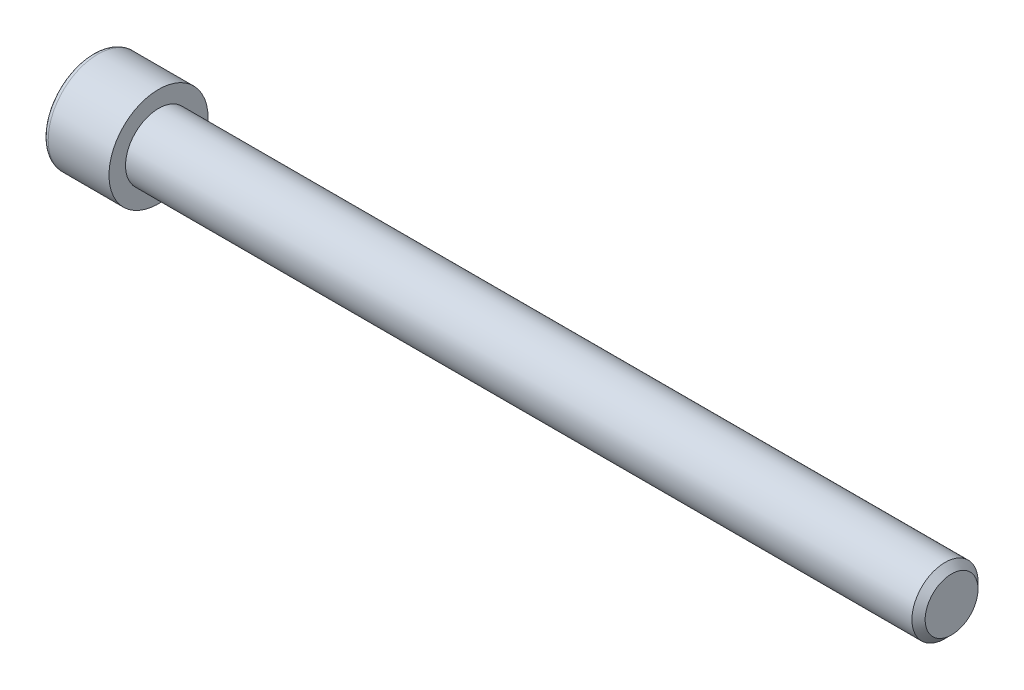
from build123d import *

# Parameters (mm, degrees)
CUT_EXTRUDE1_DEPTH = 3.9624
FILLET1_R          = 0.508
CHAMFER1_SIZE      = 0.635


with BuildPart() as part:
    # Sketch1 → Revolve1 (revolve)
    with BuildSketch(Plane.XY, mode=Mode.PRIVATE) as revolve1_sk:
        Polygon((0, 0), (82.55, 0), (82.55, 3.175), (6.35, 3.175), (6.35, 4.7625), (0, 4.7625), align=None)
    revolve(revolve1_sk.sketch.rotate(Axis((0, 0, 0), (-1, 0, 0)), 90), axis=Axis((0, 0, 0), (-1, 0, 0)))

    # Sketch2 → Cut-Extrude1 (cut)
    with BuildSketch(Plane.ZY):
        Polygon((-1.378481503, -2.3876), (1.378481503, -2.3876), (2.756963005, 0), (1.378481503, 2.3876), (-1.378481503, 2.3876), (-2.756963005, 0), align=None)
    extrude(amount=-CUT_EXTRUDE1_DEPTH, mode=Mode.SUBTRACT)

    # Fillet1
    fillet1_edges = [part.edges().sort_by_distance(p)[0] for p in [
        (0, 0, 4.7625),
    ]]
    fillet(fillet1_edges, radius=FILLET1_R)

    # Chamfer1
    chamfer1_edges = [part.edges().sort_by_distance(p)[0] for p in [
        (82.55, 0, 3.175),
    ]]
    chamfer(chamfer1_edges, length=CHAMFER1_SIZE)


solid = part.part
